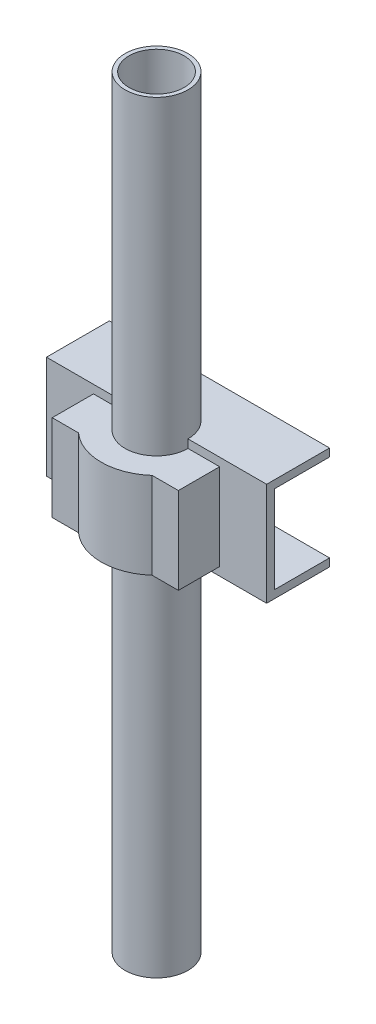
from build123d import *

# Parameters (mm, degrees)
BASE_EXTRUDE_DEPTH  = 14
SKETCH3_R           = 4
BOSS_EXTRUDE1_DEPTH = 97
SKETCH4_R           = 3.5
CUT_EXTRUDE1_DEPTH  = 37.445
SKETCH5_W           = 7
SKETCH5_H           = 11.11
CUT_EXTRUDE2_DEPTH  = 60.598657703
BOSS_EXTRUDE2_DEPTH = 5.5


with BuildPart() as part:
    # Sketch1 → Base-Extrude (new, symmetric)
    with BuildSketch(Plane(origin=(0, 0, 0), x_dir=(0, 0, -1), z_dir=(1, 0, 0))):
        Polygon((-4, -6.555), (4, -6.555), (4, -5.555), (-3, -5.555), (-3, 5.555), (4, 5.555), (4, 6.555), (-4, 6.555), align=None)
    extrude(amount=BASE_EXTRUDE_DEPTH, both=True)

    # Sketch3 → Boss-Extrude1 (add)
    with BuildSketch(Plane(origin=(0, 45, 0), x_dir=(-1, 0, 0), z_dir=(0, 1, 0))):
        with Locations(Location((0, 4, 0), (0, 0, 90))):
            Circle(SKETCH3_R)
    extrude(amount=-BOSS_EXTRUDE1_DEPTH)

    # Sketch4 → Cut-Extrude1 (cut)
    with BuildSketch(Plane(origin=(0, 45, 0), x_dir=(-1, 0, 0), z_dir=(0, 1, 0))):
        with Locations(Location((0, 4, 0), (0, 0, 90))):
            Circle(SKETCH4_R)
    extrude(amount=-CUT_EXTRUDE1_DEPTH, mode=Mode.SUBTRACT)

    # Sketch5 → Cut-Extrude2 (cut, through all)
    with BuildSketch(Plane.ZY.offset(14)):
        with Locations((-0.5, 0)):
            Rectangle(SKETCH5_W, SKETCH5_H)
    extrude(amount=-CUT_EXTRUDE2_DEPTH, mode=Mode.SUBTRACT)

    # Sketch6 → Boss-Extrude2 (add, symmetric)
    with BuildSketch(Plane(origin=(0, 0, 0), x_dir=(1, 0, 0), z_dir=(0, 1, 0))):
        with BuildLine():
            Line((8.021288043, -4), (4, -4))
            ThreePointArc((4, -4), (0, -8), (-4, -4))
            Line((-4, -4), (-8.021288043, -4))
            Line((-8.021288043, -4), (-8.021288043, -9.245495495))
            Line((-8.021288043, -9.245495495), (-4.684684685, -9.245495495))
            ThreePointArc((-4.684684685, -9.245495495), (0, -11.032886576), (4.684684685, -9.245495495))
            Line((4.684684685, -9.245495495), (8.021288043, -9.245495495))
            Line((8.021288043, -9.245495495), (8.021288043, -4))
        make_face()
    extrude(amount=BOSS_EXTRUDE2_DEPTH, both=True)


solid = part.part
